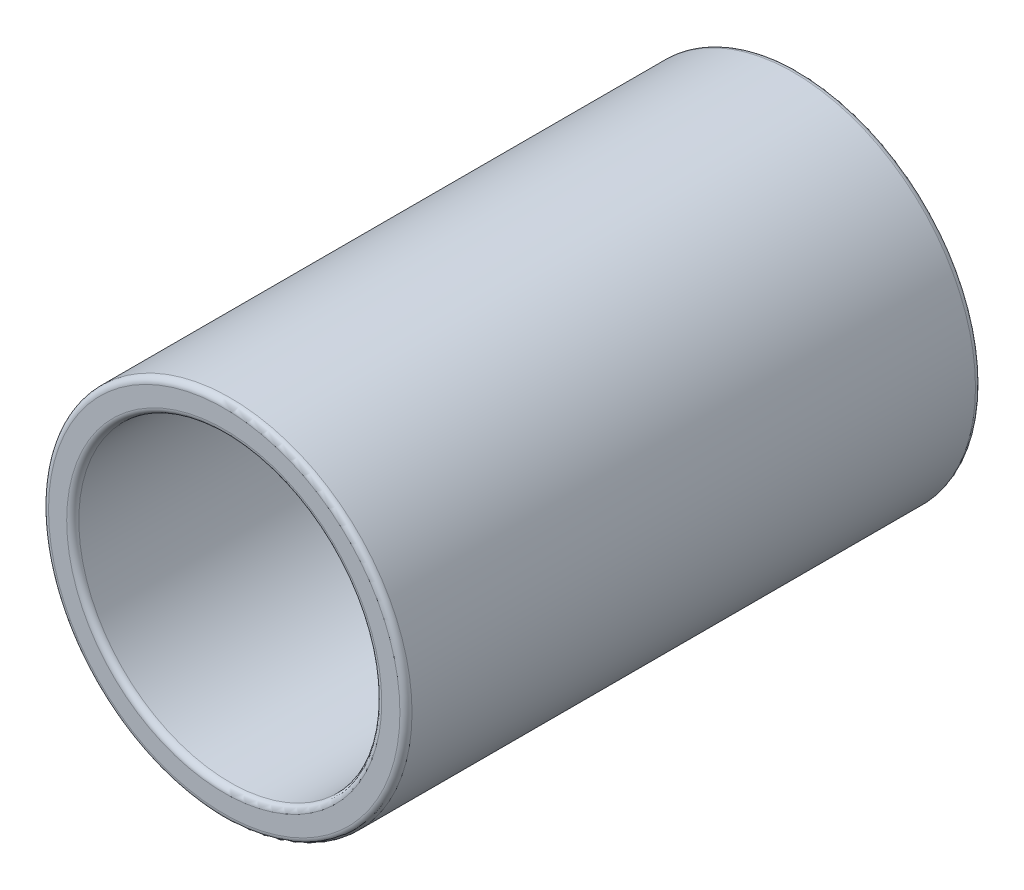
from build123d import *

# Parameters (mm, degrees)
ESQUISSE1_R      = 3
ESQUISSE1_R_2    = 2.5
EXTRUSION1_DEPTH = 9.5
CONG_1_R         = 0.1


with BuildPart() as part:
    # Esquisse1 → Extrusion1 (new body)
    with BuildSketch(Plane.XY):
        Circle(ESQUISSE1_R)
        Circle(ESQUISSE1_R_2, mode=Mode.SUBTRACT)
    extrude(amount=EXTRUSION1_DEPTH)

    # Cong_1
    cong_1_edges = [part.edges().sort_by_distance(p)[0] for p in [
        (-3, 0, 0),
        (-3, 0, 9.5),
        (-2.5, 0, 0),
        (-2.5, 0, 9.5),
    ]]
    fillet(cong_1_edges, radius=CONG_1_R)


solid = part.part
